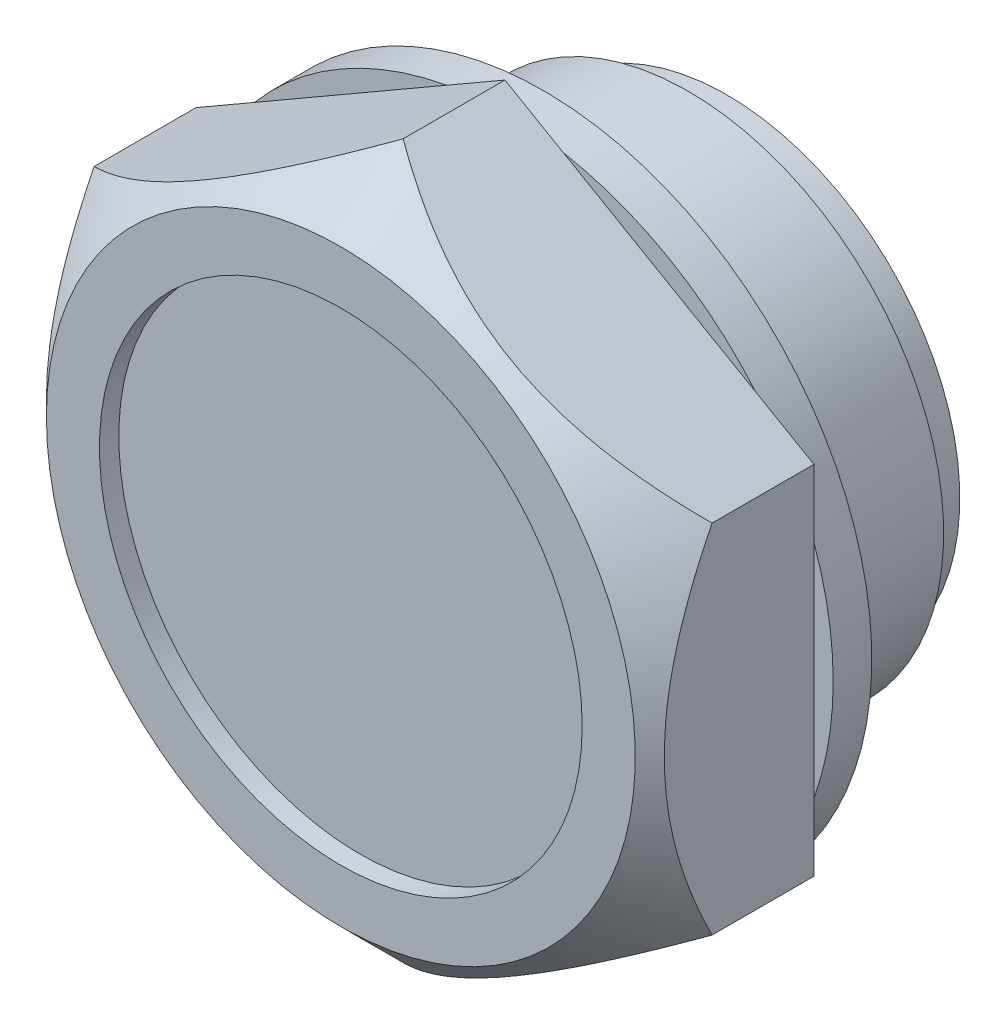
ISO-10303-21;
HEADER;
FILE_DESCRIPTION(('STEP AP214'),'2;1');
FILE_NAME('part.step','',(''),(''),'','','');
FILE_SCHEMA(('AUTOMOTIVE_DESIGN { 1 0 10303 214 1 1 1 1 }'));
ENDSEC;
DATA;
#1=APPLICATION_CONTEXT('core data for automotive mechanical design processes');
#2=APPLICATION_PROTOCOL_DEFINITION('international standard','automotive_design',2000,#1);
#3=PRODUCT_CONTEXT('',#1,'mechanical');
#4=PRODUCT('Part','Part','',(#3));
#5=PRODUCT_RELATED_PRODUCT_CATEGORY('part','',(#4));
#6=PRODUCT_DEFINITION_FORMATION('','',#4);
#7=PRODUCT_DEFINITION_CONTEXT('part definition',#1,'design');
#8=PRODUCT_DEFINITION('design','',#6,#7);
#9=PRODUCT_DEFINITION_SHAPE('','',#8);
#10=(LENGTH_UNIT() NAMED_UNIT(*) SI_UNIT(.MILLI.,.METRE.));
#11=(NAMED_UNIT(*) PLANE_ANGLE_UNIT() SI_UNIT($,.RADIAN.));
#12=(NAMED_UNIT(*) SI_UNIT($,.STERADIAN.) SOLID_ANGLE_UNIT());
#13=UNCERTAINTY_MEASURE_WITH_UNIT(LENGTH_MEASURE(1.E-05),#10,'distance_accuracy_value','');
#14=(GEOMETRIC_REPRESENTATION_CONTEXT(3) GLOBAL_UNCERTAINTY_ASSIGNED_CONTEXT((#13)) GLOBAL_UNIT_ASSIGNED_CONTEXT((#10,
#11,#12)) REPRESENTATION_CONTEXT('',''));
#15=CARTESIAN_POINT('',(0.,0.,0.));
#16=DIRECTION('',(0.,0.,1.));
#17=DIRECTION('',(1.,0.,0.));
#18=AXIS2_PLACEMENT_3D('',#15,#16,#17);
#19=CARTESIAN_POINT('',(0.,17.,2.));
#20=DIRECTION('',(0.,0.,-1.));
#21=DIRECTION('',(-1.,0.,0.));
#22=AXIS2_PLACEMENT_3D('',#19,#20,#21);
#23=PLANE('',#22);
#24=DIRECTION('',(0.866025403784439,0.5,0.));
#25=VECTOR('',#24,1.);
#26=CARTESIAN_POINT('',(-15.999999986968,9.23760429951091,2.));
#27=LINE('',#26,#25);
#28=CARTESIAN_POINT('',(-3.02506277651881,16.7286877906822,2.));
#29=VERTEX_POINT('',#28);
#30=CARTESIAN_POINT('',(4.09394740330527E-12,18.4752085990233,2.));
#31=VERTEX_POINT('',#30);
#32=EDGE_CURVE('E109',#29,#31,#27,.T.);
#33=ORIENTED_EDGE('',*,*,#32,.T.);
#34=DIRECTION('',(0.866025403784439,-0.5,0.));
#35=VECTOR('',#34,1.);
#36=CARTESIAN_POINT('',(4.09394740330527E-12,18.4752085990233,2.));
#37=LINE('',#36,#35);
#38=CARTESIAN_POINT('',(3.02506277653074,16.7286877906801,2.));
#39=VERTEX_POINT('',#38);
#40=EDGE_CURVE('E122',#31,#39,#37,.T.);
#41=ORIENTED_EDGE('',*,*,#40,.T.);
#42=CARTESIAN_POINT('',(0.,0.,2.));
#43=DIRECTION('',(0.,0.,-1.));
#44=DIRECTION('',(-1.,0.,0.));
#45=AXIS2_PLACEMENT_3D('',#42,#43,#44);
#46=CIRCLE('',#45,17.);
#47=EDGE_CURVE('E133',#29,#39,#46,.T.);
#48=ORIENTED_EDGE('',*,*,#47,.F.);
#49=EDGE_LOOP('',(#33,#41,#48));
#50=FACE_BOUND('',#49,.T.);
#51=ADVANCED_FACE('F15',(#50),#23,.T.);
#52=CARTESIAN_POINT('',(12.9749372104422,10.9841251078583,2.));
#53=VERTEX_POINT('',#52);
#54=CARTESIAN_POINT('',(16.0000000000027,9.2376042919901,2.));
#55=VERTEX_POINT('',#54);
#56=EDGE_CURVE('E132',#53,#55,#37,.T.);
#57=ORIENTED_EDGE('',*,*,#56,.T.);
#58=DIRECTION('',(-7.05455012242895E-10,-1.,0.));
#59=VECTOR('',#58,1.);
#60=CARTESIAN_POINT('',(16.0000000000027,9.2376042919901,2.));
#61=LINE('',#60,#59);
#62=CARTESIAN_POINT('',(15.9999999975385,5.744562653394,2.));
#63=VERTEX_POINT('',#62);
#64=EDGE_CURVE('E161',#55,#63,#61,.T.);
#65=ORIENTED_EDGE('',*,*,#64,.T.);
#66=EDGE_CURVE('E324',#53,#63,#46,.T.);
#67=ORIENTED_EDGE('',*,*,#66,.F.);
#68=EDGE_LOOP('',(#57,#65,#67));
#69=FACE_BOUND('',#68,.T.);
#70=ADVANCED_FACE('F294',(#69),#23,.T.);
#71=CARTESIAN_POINT('',(15.9999999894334,-5.7445626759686,2.));
#72=VERTEX_POINT('',#71);
#73=CARTESIAN_POINT('',(15.9999999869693,-9.23760429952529,2.));
#74=VERTEX_POINT('',#73);
#75=EDGE_CURVE('E130',#72,#74,#61,.T.);
#76=ORIENTED_EDGE('',*,*,#75,.T.);
#77=DIRECTION('',(-0.866025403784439,-0.5,0.));
#78=VECTOR('',#77,1.);
#79=CARTESIAN_POINT('',(15.9999999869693,-9.23760429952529,2.));
#80=LINE('',#79,#78);
#81=CARTESIAN_POINT('',(12.974937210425,-10.9841251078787,2.));
#82=VERTEX_POINT('',#81);
#83=EDGE_CURVE('E166',#74,#82,#80,.T.);
#84=ORIENTED_EDGE('',*,*,#83,.T.);
#85=EDGE_CURVE('E312',#72,#82,#46,.T.);
#86=ORIENTED_EDGE('',*,*,#85,.F.);
#87=EDGE_LOOP('',(#76,#84,#86));
#88=FACE_BOUND('',#87,.T.);
#89=ADVANCED_FACE('F298',(#88),#23,.T.);
#90=CARTESIAN_POINT('',(3.02506277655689,-16.7286877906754,2.));
#91=VERTEX_POINT('',#90);
#92=CARTESIAN_POINT('',(8.04217803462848E-12,-18.4752085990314,2.));
#93=VERTEX_POINT('',#92);
#94=EDGE_CURVE('E164',#91,#93,#80,.T.);
#95=ORIENTED_EDGE('',*,*,#94,.T.);
#96=DIRECTION('',(-0.866025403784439,0.5,0.));
#97=VECTOR('',#96,1.);
#98=CARTESIAN_POINT('',(8.04217803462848E-12,-18.4752085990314,2.));
#99=LINE('',#98,#97);
#100=CARTESIAN_POINT('',(-3.02506277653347,-16.7286877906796,2.));
#101=VERTEX_POINT('',#100);
#102=EDGE_CURVE('E172',#93,#101,#99,.T.);
#103=ORIENTED_EDGE('',*,*,#102,.T.);
#104=EDGE_CURVE('E380',#91,#101,#46,.T.);
#105=ORIENTED_EDGE('',*,*,#104,.F.);
#106=EDGE_LOOP('',(#95,#103,#105));
#107=FACE_BOUND('',#106,.T.);
#108=ADVANCED_FACE('F302',(#107),#23,.T.);
#109=CARTESIAN_POINT('',(-15.999999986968,9.23760429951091,2.));
#110=VERTEX_POINT('',#109);
#111=CARTESIAN_POINT('',(-12.97493721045,10.9841251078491,2.));
#112=VERTEX_POINT('',#111);
#113=EDGE_CURVE('E139',#110,#112,#27,.T.);
#114=ORIENTED_EDGE('',*,*,#113,.T.);
#115=CARTESIAN_POINT('',(-15.999999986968,5.74456268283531,2.));
#116=VERTEX_POINT('',#115);
#117=EDGE_CURVE('E24',#116,#112,#46,.T.);
#118=ORIENTED_EDGE('',*,*,#117,.F.);
#119=DIRECTION('',(0.,1.,0.));
#120=VECTOR('',#119,1.);
#121=CARTESIAN_POINT('',(-15.999999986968,-9.23760429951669,2.));
#122=LINE('',#121,#120);
#123=EDGE_CURVE('E176',#116,#110,#122,.T.);
#124=ORIENTED_EDGE('',*,*,#123,.T.);
#125=EDGE_LOOP('',(#114,#118,#124));
#126=FACE_BOUND('',#125,.T.);
#127=ADVANCED_FACE('F291',(#126),#23,.T.);
#128=CARTESIAN_POINT('',(0.,0.,-9.5));
#129=DIRECTION('',(0.,0.,-1.));
#130=DIRECTION('',(-1.,0.,0.));
#131=AXIS2_PLACEMENT_3D('',#128,#129,#130);
#132=PLANE('',#131);
#133=CARTESIAN_POINT('',(0.,0.,-9.5));
#134=DIRECTION('',(0.,0.,-1.));
#135=DIRECTION('',(-1.,0.,0.));
#136=AXIS2_PLACEMENT_3D('',#133,#134,#135);
#137=CIRCLE('',#136,12.0585);
#138=CARTESIAN_POINT('',(-12.0585,0.,-9.5));
#139=VERTEX_POINT('',#138);
#140=EDGE_CURVE('E349',#139,#139,#137,.T.);
#141=ORIENTED_EDGE('',*,*,#140,.T.);
#142=EDGE_LOOP('',(#141));
#143=FACE_BOUND('',#142,.T.);
#144=ADVANCED_FACE('F17',(#143),#132,.T.);
#145=CARTESIAN_POINT('',(-12.9749372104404,-10.9841251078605,2.));
#146=VERTEX_POINT('',#145);
#147=CARTESIAN_POINT('',(-15.999999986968,-9.23760429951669,2.));
#148=VERTEX_POINT('',#147);
#149=EDGE_CURVE('E170',#146,#148,#99,.T.);
#150=ORIENTED_EDGE('',*,*,#149,.T.);
#151=CARTESIAN_POINT('',(-15.999999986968,-5.7445626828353,2.));
#152=VERTEX_POINT('',#151);
#153=EDGE_CURVE('E178',#148,#152,#122,.T.);
#154=ORIENTED_EDGE('',*,*,#153,.T.);
#155=EDGE_CURVE('E391',#146,#152,#46,.T.);
#156=ORIENTED_EDGE('',*,*,#155,.F.);
#157=EDGE_LOOP('',(#150,#154,#156));
#158=FACE_BOUND('',#157,.T.);
#159=ADVANCED_FACE('F224',(#158),#23,.T.);
#160=CARTESIAN_POINT('',(0.,0.,-13.9684898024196));
#161=DIRECTION('',(0.,0.,-1.));
#162=DIRECTION('',(-1.,0.,0.));
#163=AXIS2_PLACEMENT_3D('',#160,#161,#162);
#164=CYLINDRICAL_SURFACE('',#163,17.);
#165=ORIENTED_EDGE('',*,*,#117,.T.);
#166=EDGE_CURVE('E332',#112,#29,#46,.T.);
#167=ORIENTED_EDGE('',*,*,#166,.T.);
#168=ORIENTED_EDGE('',*,*,#47,.T.);
#169=EDGE_CURVE('E326',#39,#53,#46,.T.);
#170=ORIENTED_EDGE('',*,*,#169,.T.);
#171=ORIENTED_EDGE('',*,*,#66,.T.);
#172=EDGE_CURVE('E321',#63,#72,#46,.T.);
#173=ORIENTED_EDGE('',*,*,#172,.T.);
#174=ORIENTED_EDGE('',*,*,#85,.T.);
#175=EDGE_CURVE('E384',#82,#91,#46,.T.);
#176=ORIENTED_EDGE('',*,*,#175,.T.);
#177=ORIENTED_EDGE('',*,*,#104,.T.);
#178=EDGE_CURVE('E388',#101,#146,#46,.T.);
#179=ORIENTED_EDGE('',*,*,#178,.T.);
#180=ORIENTED_EDGE('',*,*,#155,.T.);
#181=EDGE_CURVE('E333',#152,#116,#46,.T.);
#182=ORIENTED_EDGE('',*,*,#181,.T.);
#183=EDGE_LOOP('',(#165,#167,#168,#170,#171,#173,#174,#176,#177,#179,#180,#182));
#184=FACE_BOUND('',#183,.T.);
#185=CARTESIAN_POINT('',(0.,0.,0.));
#186=DIRECTION('',(0.,0.,-1.));
#187=DIRECTION('',(-1.,0.,0.));
#188=AXIS2_PLACEMENT_3D('',#185,#186,#187);
#189=CIRCLE('',#188,17.);
#190=CARTESIAN_POINT('',(-17.,0.,0.));
#191=VERTEX_POINT('',#190);
#192=EDGE_CURVE('E334',#191,#191,#189,.T.);
#193=ORIENTED_EDGE('',*,*,#192,.F.);
#194=EDGE_LOOP('',(#193));
#195=FACE_BOUND('',#194,.T.);
#196=ADVANCED_FACE('F282',(#184,#195),#164,.T.);
#197=CARTESIAN_POINT('',(0.,13.2205,0.));
#198=DIRECTION('',(0.,0.,-1.));
#199=DIRECTION('',(-1.,0.,0.));
#200=AXIS2_PLACEMENT_3D('',#197,#198,#199);
#201=PLANE('',#200);
#202=ORIENTED_EDGE('',*,*,#192,.T.);
#203=EDGE_LOOP('',(#202));
#204=FACE_BOUND('',#203,.T.);
#205=CARTESIAN_POINT('',(0.,0.,0.));
#206=DIRECTION('',(0.,0.,-1.));
#207=DIRECTION('',(-1.,0.,0.));
#208=AXIS2_PLACEMENT_3D('',#205,#206,#207);
#209=CIRCLE('',#208,13.2205);
#210=CARTESIAN_POINT('',(-13.2205,0.,0.));
#211=VERTEX_POINT('',#210);
#212=EDGE_CURVE('E338',#211,#211,#209,.T.);
#213=ORIENTED_EDGE('',*,*,#212,.F.);
#214=EDGE_LOOP('',(#213));
#215=FACE_BOUND('',#214,.T.);
#216=ADVANCED_FACE('F279',(#204,#215),#201,.T.);
#217=CARTESIAN_POINT('',(0.,0.,-13.9684898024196));
#218=DIRECTION('',(0.,0.,-1.));
#219=DIRECTION('',(-1.,0.,0.));
#220=AXIS2_PLACEMENT_3D('',#217,#218,#219);
#221=CYLINDRICAL_SURFACE('',#220,13.2205);
#222=CARTESIAN_POINT('',(0.,0.,-7.5));
#223=DIRECTION('',(0.,0.,-1.));
#224=DIRECTION('',(-1.,0.,0.));
#225=AXIS2_PLACEMENT_3D('',#222,#223,#224);
#226=CIRCLE('',#225,13.2205);
#227=CARTESIAN_POINT('',(-13.2205,0.,-7.5));
#228=VERTEX_POINT('',#227);
#229=EDGE_CURVE('E342',#228,#228,#226,.T.);
#230=ORIENTED_EDGE('',*,*,#229,.F.);
#231=EDGE_LOOP('',(#230));
#232=FACE_BOUND('',#231,.T.);
#233=ORIENTED_EDGE('',*,*,#212,.T.);
#234=EDGE_LOOP('',(#233));
#235=FACE_BOUND('',#234,.T.);
#236=ADVANCED_FACE('F275',(#232,#235),#221,.T.);
#237=CARTESIAN_POINT('',(0.,12.0585,-7.5));
#238=DIRECTION('',(0.,0.,-1.));
#239=DIRECTION('',(-1.,0.,0.));
#240=AXIS2_PLACEMENT_3D('',#237,#238,#239);
#241=PLANE('',#240);
#242=ORIENTED_EDGE('',*,*,#229,.T.);
#243=EDGE_LOOP('',(#242));
#244=FACE_BOUND('',#243,.T.);
#245=CARTESIAN_POINT('',(0.,0.,-7.5));
#246=DIRECTION('',(0.,0.,-1.));
#247=DIRECTION('',(-1.,0.,0.));
#248=AXIS2_PLACEMENT_3D('',#245,#246,#247);
#249=CIRCLE('',#248,12.0585);
#250=CARTESIAN_POINT('',(-12.0585,0.,-7.5));
#251=VERTEX_POINT('',#250);
#252=EDGE_CURVE('E346',#251,#251,#249,.T.);
#253=ORIENTED_EDGE('',*,*,#252,.F.);
#254=EDGE_LOOP('',(#253));
#255=FACE_BOUND('',#254,.T.);
#256=ADVANCED_FACE('F271',(#244,#255),#241,.T.);
#257=CARTESIAN_POINT('',(0.,0.,-13.9684898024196));
#258=DIRECTION('',(0.,0.,-1.));
#259=DIRECTION('',(-1.,0.,0.));
#260=AXIS2_PLACEMENT_3D('',#257,#258,#259);
#261=CYLINDRICAL_SURFACE('',#260,12.0585);
#262=ORIENTED_EDGE('',*,*,#140,.F.);
#263=EDGE_LOOP('',(#262));
#264=FACE_BOUND('',#263,.T.);
#265=ORIENTED_EDGE('',*,*,#252,.T.);
#266=EDGE_LOOP('',(#265));
#267=FACE_BOUND('',#266,.T.);
#268=ADVANCED_FACE('F268',(#264,#267),#261,.T.);
#269=CARTESIAN_POINT('',(-15.999999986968,9.23760429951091,2.));
#270=DIRECTION('',(0.5,-0.866025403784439,0.));
#271=DIRECTION('',(-0.866025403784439,-0.5,0.));
#272=AXIS2_PLACEMENT_3D('',#269,#270,#271);
#273=PLANE('',#272);
#274=DIRECTION('',(0.,0.,1.));
#275=VECTOR('',#274,1.);
#276=CARTESIAN_POINT('',(4.09394740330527E-12,18.4752085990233,2.));
#277=LINE('',#276,#275);
#278=CARTESIAN_POINT('',(4.09394740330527E-12,18.4752085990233,7.27479138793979));
#279=VERTEX_POINT('',#278);
#280=EDGE_CURVE('E104',#31,#279,#277,.T.);
#281=ORIENTED_EDGE('',*,*,#280,.F.);
#282=ORIENTED_EDGE('',*,*,#32,.F.);
#283=EDGE_CURVE('E136',#112,#29,#27,.T.);
#284=ORIENTED_EDGE('',*,*,#283,.F.);
#285=ORIENTED_EDGE('',*,*,#113,.F.);
#286=DIRECTION('',(0.,0.,1.));
#287=VECTOR('',#286,1.);
#288=CARTESIAN_POINT('',(-15.999999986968,9.23760429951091,2.));
#289=LINE('',#288,#287);
#290=CARTESIAN_POINT('',(-15.999999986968,9.23760429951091,7.27479138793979));
#291=VERTEX_POINT('',#290);
#292=EDGE_CURVE('E182',#110,#291,#289,.T.);
#293=ORIENTED_EDGE('',*,*,#292,.T.);
#294=CARTESIAN_POINT('',(0.000200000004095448,18.4753240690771,7.27467591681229));
#295=CARTESIAN_POINT('',(-0.274873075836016,18.316510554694,7.43346500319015));
#296=CARTESIAN_POINT('',(-0.552100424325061,18.1564532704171,7.58740864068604));
#297=CARTESIAN_POINT('',(-1.11119892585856,17.8336576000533,7.88406590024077));
#298=CARTESIAN_POINT('',(-1.39307251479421,17.6709178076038,8.02677338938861));
#299=CARTESIAN_POINT('',(-1.96312819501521,17.3417960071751,8.30002357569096));
#300=CARTESIAN_POINT('',(-2.2513371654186,17.1753984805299,8.43049194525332));
#301=CARTESIAN_POINT('',(-2.83248894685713,16.8398703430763,8.67643022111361));
#302=CARTESIAN_POINT('',(-3.12543102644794,16.6707401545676,8.79190242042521));
#303=CARTESIAN_POINT('',(-3.71133791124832,16.332466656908,9.00419506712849));
#304=CARTESIAN_POINT('',(-4.00423072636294,16.1633649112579,9.10127894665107));
#305=CARTESIAN_POINT('',(-4.59412538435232,15.8227890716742,9.27703969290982));
#306=CARTESIAN_POINT('',(-4.89112678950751,15.6513152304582,9.35571850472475));
#307=CARTESIAN_POINT('',(-5.48795464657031,15.3067365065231,9.49269195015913));
#308=CARTESIAN_POINT('',(-5.78777314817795,15.1336362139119,9.55103248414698));
#309=CARTESIAN_POINT('',(-6.38996474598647,14.7859607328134,9.64603292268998));
#310=CARTESIAN_POINT('',(-6.69233745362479,14.6113857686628,9.68269606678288));
#311=CARTESIAN_POINT('',(-7.21228046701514,14.3111965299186,9.72611550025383));
#312=CARTESIAN_POINT('',(-7.42951394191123,14.1857767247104,9.7384116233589));
#313=CARTESIAN_POINT('',(-7.86423666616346,13.9347894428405,9.75119864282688));
#314=CARTESIAN_POINT('',(-8.08172590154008,13.80922197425,9.75169015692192));
#315=CARTESIAN_POINT('',(-8.51656301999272,13.5581686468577,9.74085342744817));
#316=CARTESIAN_POINT('',(-8.73391082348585,13.4326828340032,9.72952090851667));
#317=CARTESIAN_POINT('',(-9.16790378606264,13.1821168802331,9.69521554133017));
#318=CARTESIAN_POINT('',(-9.38454893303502,13.0570367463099,9.6722424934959));
#319=CARTESIAN_POINT('',(-10.0332285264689,12.6825214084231,9.58626640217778));
#320=CARTESIAN_POINT('',(-10.4636398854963,12.4340232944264,9.5062164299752));
#321=CARTESIAN_POINT('',(-11.3169944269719,11.9413388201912,9.30503457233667));
#322=CARTESIAN_POINT('',(-11.7399381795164,11.6971521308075,9.18390583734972));
#323=CARTESIAN_POINT('',(-12.4907260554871,11.2636845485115,8.93472063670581));
#324=CARTESIAN_POINT('',(-12.8202293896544,11.0734457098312,8.81321948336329));
#325=CARTESIAN_POINT('',(-13.4733181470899,10.6963847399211,8.55063894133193));
#326=CARTESIAN_POINT('',(-13.7969033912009,10.5095627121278,8.40955896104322));
#327=CARTESIAN_POINT('',(-14.4371411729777,10.1399212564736,8.11098332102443));
#328=CARTESIAN_POINT('',(-14.7538119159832,9.95709131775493,7.95353928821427));
#329=CARTESIAN_POINT('',(-15.3812901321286,9.59481660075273,7.62430209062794));
#330=CARTESIAN_POINT('',(-15.6921010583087,9.41536982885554,7.45251772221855));
#331=CARTESIAN_POINT('',(-16.0001999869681,9.23748882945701,7.27467591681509));
#332=B_SPLINE_CURVE_WITH_KNOTS('',3,(#294,#295,#296,#297,#298,#299,#300,#301,#302,#303,#304,
#305,#306,#307,#308,#309,#310,#311,#312,#313,#314,#315,#316,#317,#318,#319,#320,#321,#322,#323,
#324,#325,#326,#327,#328,#329,#330,#331),.UNSPECIFIED.,.F.,.F.,(4,2,2,2,2,2,2,2,2,2,2,2,2,2,2,2,
2,2,4),(0.,1.06536581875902,2.13130916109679,3.20335555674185,4.27523783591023,5.33035841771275,
6.38536744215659,7.43797982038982,8.49043485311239,9.24359927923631,9.99672429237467,
10.7501217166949,11.5035320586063,13.0116203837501,14.5195930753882,15.7172424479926,
16.9149280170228,18.1089435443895,19.3022319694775),.UNSPECIFIED.);
#333=EDGE_CURVE('E113',#279,#291,#332,.T.);
#334=ORIENTED_EDGE('',*,*,#333,.F.);
#335=EDGE_LOOP('',(#281,#282,#284,#285,#293,#334));
#336=FACE_BOUND('',#335,.T.);
#337=ADVANCED_FACE('F106',(#336),#273,.F.);
#338=CARTESIAN_POINT('',(4.09394740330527E-12,18.4752085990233,2.));
#339=DIRECTION('',(-0.5,-0.866025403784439,0.));
#340=DIRECTION('',(-0.866025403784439,0.5,0.));
#341=AXIS2_PLACEMENT_3D('',#338,#339,#340);
#342=PLANE('',#341);
#343=DIRECTION('',(0.,0.,1.));
#344=VECTOR('',#343,1.);
#345=CARTESIAN_POINT('',(16.0000000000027,9.2376042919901,2.));
#346=LINE('',#345,#344);
#347=CARTESIAN_POINT('',(16.0000000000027,9.2376042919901,7.27479138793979));
#348=VERTEX_POINT('',#347);
#349=EDGE_CURVE('E118',#55,#348,#346,.T.);
#350=ORIENTED_EDGE('',*,*,#349,.F.);
#351=ORIENTED_EDGE('',*,*,#56,.F.);
#352=EDGE_CURVE('E125',#39,#53,#37,.T.);
#353=ORIENTED_EDGE('',*,*,#352,.F.);
#354=ORIENTED_EDGE('',*,*,#40,.F.);
#355=ORIENTED_EDGE('',*,*,#280,.T.);
#356=CARTESIAN_POINT('',(16.0002000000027,9.2374888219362,7.2746759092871));
#357=CARTESIAN_POINT('',(15.7251269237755,9.39630233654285,7.43346499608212));
#358=CARTESIAN_POINT('',(15.4478995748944,9.55635962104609,7.58740863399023));
#359=CARTESIAN_POINT('',(14.8888010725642,9.87915529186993,7.88406589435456));
#360=CARTESIAN_POINT('',(14.606927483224,10.041895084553,8.02677338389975));
#361=CARTESIAN_POINT('',(14.0368718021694,10.3710168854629,8.30002357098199));
#362=CARTESIAN_POINT('',(13.7486628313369,10.5374144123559,8.43049194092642));
#363=CARTESIAN_POINT('',(13.1675110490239,10.8729425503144,8.67643021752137));
#364=CARTESIAN_POINT('',(12.8745689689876,11.0420727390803,8.79190241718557));
#365=CARTESIAN_POINT('',(12.2886620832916,11.3803462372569,9.0041950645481));
#366=CARTESIAN_POINT('',(11.9957692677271,11.5494479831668,9.10127894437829));
#367=CARTESIAN_POINT('',(11.4058746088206,11.8900238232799,9.2770396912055));
#368=CARTESIAN_POINT('',(11.1088732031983,12.0614976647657,9.3557185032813));
#369=CARTESIAN_POINT('',(10.5120453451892,12.4060763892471,9.49269194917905));
#370=CARTESIAN_POINT('',(10.2122268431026,12.5791766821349,9.55103248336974));
#371=CARTESIAN_POINT('',(9.61003524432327,12.9268521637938,9.64603292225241));
#372=CARTESIAN_POINT('',(9.30766253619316,13.1014271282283,9.68269606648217));
#373=CARTESIAN_POINT('',(8.78771952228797,13.4016163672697,9.72611550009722));
#374=CARTESIAN_POINT('',(8.57048604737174,13.5270361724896,9.73841162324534));
#375=CARTESIAN_POINT('',(8.13576332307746,13.7780234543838,9.75119864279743));
#376=CARTESIAN_POINT('',(7.91827408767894,13.903590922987,9.75169015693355));
#377=CARTESIAN_POINT('',(7.48343696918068,14.1546442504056,9.74085342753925));
#378=CARTESIAN_POINT('',(7.26608916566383,14.2801300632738,9.72952090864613));
#379=CARTESIAN_POINT('',(6.83209620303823,14.5306960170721,9.69521554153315));
#380=CARTESIAN_POINT('',(6.61545105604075,14.6557761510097,9.67224249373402));
#381=CARTESIAN_POINT('',(5.96677146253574,15.0302914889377,9.58626640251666));
#382=CARTESIAN_POINT('',(5.53636010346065,15.278789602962,9.5062164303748));
#383=CARTESIAN_POINT('',(4.68300556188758,15.7714740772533,9.30503457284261));
#384=CARTESIAN_POINT('',(4.26006180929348,16.0156607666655,9.1839058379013));
#385=CARTESIAN_POINT('',(3.50927393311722,16.4491283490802,8.93472063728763));
#386=CARTESIAN_POINT('',(3.17977059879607,16.6393671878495,8.81321948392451));
#387=CARTESIAN_POINT('',(2.52668184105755,17.0164281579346,8.55063894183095));
#388=CARTESIAN_POINT('',(2.20309659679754,17.2032501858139,8.40955896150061));
#389=CARTESIAN_POINT('',(1.5628588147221,17.5728916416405,8.1109833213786));
#390=CARTESIAN_POINT('',(1.24618807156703,17.7557215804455,7.95353928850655));
#391=CARTESIAN_POINT('',(0.618709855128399,18.117996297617,7.62430209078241));
#392=CARTESIAN_POINT('',(0.307898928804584,18.2974430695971,7.4525177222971));
#393=CARTESIAN_POINT('',(-0.000199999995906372,18.4753240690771,7.27467591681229));
#394=B_SPLINE_CURVE_WITH_KNOTS('',3,(#356,#357,#358,#359,#360,#361,#362,#363,#364,#365,#366,
#367,#368,#369,#370,#371,#372,#373,#374,#375,#376,#377,#378,#379,#380,#381,#382,#383,#384,#385,
#386,#387,#388,#389,#390,#391,#392,#393),.UNSPECIFIED.,.F.,.F.,(4,2,2,2,2,2,2,2,2,2,2,2,2,2,2,2,
2,2,4),(0.,1.06536582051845,2.13130916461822,3.20335556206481,4.27523784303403,5.33035842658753,
6.38536745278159,7.4379798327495,8.49043486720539,9.24359929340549,9.99672430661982,
10.7501217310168,11.5035320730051,13.0116203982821,14.5195930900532,15.7172424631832,
16.9149280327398,18.1089435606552,19.3022319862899),.UNSPECIFIED.);
#395=EDGE_CURVE('E246',#348,#279,#394,.T.);
#396=ORIENTED_EDGE('',*,*,#395,.F.);
#397=EDGE_LOOP('',(#350,#351,#353,#354,#355,#396));
#398=FACE_BOUND('',#397,.T.);
#399=ADVANCED_FACE('F123',(#398),#342,.F.);
#400=CARTESIAN_POINT('',(16.0000000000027,9.2376042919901,2.));
#401=DIRECTION('',(-1.,7.05455012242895E-10,0.));
#402=DIRECTION('',(7.05455012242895E-10,1.,0.));
#403=AXIS2_PLACEMENT_3D('',#400,#401,#402);
#404=PLANE('',#403);
#405=DIRECTION('',(0.,0.,1.));
#406=VECTOR('',#405,1.);
#407=CARTESIAN_POINT('',(15.9999999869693,-9.23760429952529,2.));
#408=LINE('',#407,#406);
#409=CARTESIAN_POINT('',(15.9999999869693,-9.23760429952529,7.27479138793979));
#410=VERTEX_POINT('',#409);
#411=EDGE_CURVE('E191',#74,#410,#408,.T.);
#412=ORIENTED_EDGE('',*,*,#411,.F.);
#413=ORIENTED_EDGE('',*,*,#75,.F.);
#414=EDGE_CURVE('E165',#63,#72,#61,.T.);
#415=ORIENTED_EDGE('',*,*,#414,.F.);
#416=ORIENTED_EDGE('',*,*,#64,.F.);
#417=ORIENTED_EDGE('',*,*,#349,.T.);
#418=CARTESIAN_POINT('',(15.9999999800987,-18.9766913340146,0.928339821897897));
#419=CARTESIAN_POINT('',(15.9999999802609,-18.746877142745,1.1040346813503));
#420=CARTESIAN_POINT('',(15.9999999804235,-18.5164265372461,1.2788964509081));
#421=CARTESIAN_POINT('',(15.9999999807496,-18.054146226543,1.62679531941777));
#422=CARTESIAN_POINT('',(15.9999999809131,-17.8223164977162,1.79983238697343));
#423=CARTESIAN_POINT('',(15.9999999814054,-17.1245063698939,2.31603724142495));
#424=CARTESIAN_POINT('',(15.9999999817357,-16.6563084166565,2.65621942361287));
#425=CARTESIAN_POINT('',(15.9999999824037,-15.7094360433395,3.32959149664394));
#426=CARTESIAN_POINT('',(15.9999999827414,-15.2307086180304,3.66270701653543));
#427=CARTESIAN_POINT('',(15.9999999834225,-14.2652298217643,4.31706338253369));
#428=CARTESIAN_POINT('',(15.9999999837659,-13.7784790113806,4.63830505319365));
#429=CARTESIAN_POINT('',(15.9999999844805,-12.7655565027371,5.28543641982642));
#430=CARTESIAN_POINT('',(15.9999999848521,-12.2387951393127,5.61040773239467));
#431=CARTESIAN_POINT('',(15.999999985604,-11.1729235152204,6.23976792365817));
#432=CARTESIAN_POINT('',(15.9999999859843,-10.6338112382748,6.54415340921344));
#433=CARTESIAN_POINT('',(15.9999999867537,-9.54316200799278,7.12582877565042));
#434=CARTESIAN_POINT('',(15.9999999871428,-8.99166784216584,7.40319826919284));
#435=CARTESIAN_POINT('',(15.9999999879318,-7.87326854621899,7.92462900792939));
#436=CARTESIAN_POINT('',(15.9999999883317,-7.30637073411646,8.16870574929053));
#437=CARTESIAN_POINT('',(15.9999999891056,-6.20930944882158,8.59412127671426));
#438=CARTESIAN_POINT('',(15.9999999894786,-5.68059858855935,8.77917494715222));
#439=CARTESIAN_POINT('',(15.9999999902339,-4.60986280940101,9.10693512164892));
#440=CARTESIAN_POINT('',(15.9999999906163,-4.06783702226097,9.24963885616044));
#441=CARTESIAN_POINT('',(15.9999999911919,-3.25190269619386,9.42499213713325));
#442=CARTESIAN_POINT('',(15.9999999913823,-2.98200989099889,9.4766801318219));
#443=CARTESIAN_POINT('',(15.9999999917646,-2.44009014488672,9.56720843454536));
#444=CARTESIAN_POINT('',(15.9999999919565,-2.16806350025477,9.60605049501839));
#445=CARTESIAN_POINT('',(15.9999999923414,-1.6224399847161,9.67023281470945));
#446=CARTESIAN_POINT('',(15.9999999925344,-1.34884323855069,9.69557413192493));
#447=CARTESIAN_POINT('',(15.9999999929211,-0.800711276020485,9.73231048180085));
#448=CARTESIAN_POINT('',(15.9999999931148,-0.526176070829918,9.74370567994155));
#449=CARTESIAN_POINT('',(15.9999999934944,0.011849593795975,9.75216323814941));
#450=CARTESIAN_POINT('',(15.9999999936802,0.275331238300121,9.74979427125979));
#451=CARTESIAN_POINT('',(15.9999999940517,0.801885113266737,9.73207967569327));
#452=CARTESIAN_POINT('',(15.9999999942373,1.06495729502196,9.71673260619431));
#453=CARTESIAN_POINT('',(15.9999999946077,1.59003377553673,9.67331599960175));
#454=CARTESIAN_POINT('',(15.9999999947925,1.8520381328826,9.64524717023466));
#455=CARTESIAN_POINT('',(15.9999999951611,2.37445310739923,9.57684662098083));
#456=CARTESIAN_POINT('',(15.9999999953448,2.63486351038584,9.53651328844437));
#457=CARTESIAN_POINT('',(15.9999999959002,3.42214842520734,9.39635593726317));
#458=CARTESIAN_POINT('',(15.9999999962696,3.94583431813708,9.27816696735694));
#459=CARTESIAN_POINT('',(15.9999999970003,4.98162600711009,8.99985914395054));
#460=CARTESIAN_POINT('',(15.9999999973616,5.49373257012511,8.83974307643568));
#461=CARTESIAN_POINT('',(15.9999999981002,6.54074357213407,8.47213735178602));
#462=CARTESIAN_POINT('',(15.9999999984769,7.0747548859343,8.26212657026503));
#463=CARTESIAN_POINT('',(15.9999999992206,8.12899321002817,7.80972137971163));
#464=CARTESIAN_POINT('',(15.9999999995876,8.64921380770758,7.56731221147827));
#465=CARTESIAN_POINT('',(16.0000000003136,9.67836399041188,7.05586433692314));
#466=CARTESIAN_POINT('',(16.0000000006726,10.1872522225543,6.78674307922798));
#467=CARTESIAN_POINT('',(16.0000000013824,11.1933518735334,6.22780208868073));
#468=CARTESIAN_POINT('',(16.0000000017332,11.6905650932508,5.9379855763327));
#469=CARTESIAN_POINT('',(16.0000000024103,12.6504962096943,5.35645654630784));
#470=CARTESIAN_POINT('',(16.0000000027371,13.1137034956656,5.06554765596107));
#471=CARTESIAN_POINT('',(16.000000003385,14.0321620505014,4.47139694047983));
#472=CARTESIAN_POINT('',(16.0000000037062,14.4874127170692,4.16815418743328));
#473=CARTESIAN_POINT('',(16.0000000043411,15.387325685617,3.55399764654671));
#474=CARTESIAN_POINT('',(16.0000000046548,15.8320437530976,3.24316537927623));
#475=CARTESIAN_POINT('',(16.0000000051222,16.4945916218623,2.77071287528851));
#476=CARTESIAN_POINT('',(16.0000000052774,16.7146581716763,2.61221536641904));
#477=CARTESIAN_POINT('',(16.0000000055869,17.1533959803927,2.29330969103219));
#478=CARTESIAN_POINT('',(16.0000000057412,17.3720672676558,2.13290156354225));
#479=CARTESIAN_POINT('',(16.000000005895,17.5900928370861,1.97161976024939));
#480=B_SPLINE_CURVE_WITH_KNOTS('',3,(#418,#419,#420,#421,#422,#423,#424,#425,#426,#427,#428,
#429,#430,#431,#432,#433,#434,#435,#436,#437,#438,#439,#440,#441,#442,#443,#444,#445,#446,#447,
#448,#449,#450,#451,#452,#453,#454,#455,#456,#457,#458,#459,#460,#461,#462,#463,#464,#465,#466,
#467,#468,#469,#470,#471,#472,#473,#474,#475,#476,#477,#478,#479),.UNSPECIFIED.,.F.,.F.,(4,2,2,
2,2,2,2,2,2,2,2,2,2,2,2,2,2,2,2,2,2,2,2,2,2,2,2,2,2,2,4),(0.,0.867838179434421,1.73569126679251,
3.47178820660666,5.22130427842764,6.97069862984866,8.8271383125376,10.6838832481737,
12.5349796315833,14.3852114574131,16.0642962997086,17.7434909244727,18.5676273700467,
19.3916513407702,20.2156107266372,21.0395603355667,21.8297168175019,22.6199610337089,
23.4101612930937,24.2004655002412,25.8087949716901,27.4170175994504,29.1371437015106,
30.8580561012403,32.5844630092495,34.3106018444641,35.9513164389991,37.5921546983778,
39.2197688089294,40.0333676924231,40.8469499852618),.UNSPECIFIED.);
#481=EDGE_CURVE('E239',#410,#348,#480,.T.);
#482=ORIENTED_EDGE('',*,*,#481,.F.);
#483=EDGE_LOOP('',(#412,#413,#415,#416,#417,#482));
#484=FACE_BOUND('',#483,.T.);
#485=ADVANCED_FACE('F261',(#484),#404,.F.);
#486=CARTESIAN_POINT('',(15.9999999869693,-9.23760429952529,2.));
#487=DIRECTION('',(-0.5,0.866025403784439,0.));
#488=DIRECTION('',(0.866025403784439,0.5,0.));
#489=AXIS2_PLACEMENT_3D('',#486,#487,#488);
#490=PLANE('',#489);
#491=DIRECTION('',(0.,0.,1.));
#492=VECTOR('',#491,1.);
#493=CARTESIAN_POINT('',(8.04217803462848E-12,-18.4752085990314,2.));
#494=LINE('',#493,#492);
#495=CARTESIAN_POINT('',(8.04217803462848E-12,-18.4752085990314,7.27479138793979));
#496=VERTEX_POINT('',#495);
#497=EDGE_CURVE('E187',#93,#496,#494,.T.);
#498=ORIENTED_EDGE('',*,*,#497,.F.);
#499=ORIENTED_EDGE('',*,*,#94,.F.);
#500=EDGE_CURVE('E171',#82,#91,#80,.T.);
#501=ORIENTED_EDGE('',*,*,#500,.F.);
#502=ORIENTED_EDGE('',*,*,#83,.F.);
#503=ORIENTED_EDGE('',*,*,#411,.T.);
#504=CARTESIAN_POINT('',(-0.000199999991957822,-18.4753240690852,7.2746759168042));
#505=CARTESIAN_POINT('',(0.274873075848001,-18.3165105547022,7.43346500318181));
#506=CARTESIAN_POINT('',(0.552100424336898,-18.1564532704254,7.58740864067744));
#507=CARTESIAN_POINT('',(1.1111989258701,-17.8336576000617,7.88406590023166));
#508=CARTESIAN_POINT('',(1.3930725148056,-17.6709178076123,8.02677338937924));
#509=CARTESIAN_POINT('',(1.96312819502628,-17.3417960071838,8.30002357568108));
#510=CARTESIAN_POINT('',(2.25133716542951,-17.1753984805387,8.4304919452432));
#511=CARTESIAN_POINT('',(2.83248894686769,-16.8398703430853,8.67643022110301));
#512=CARTESIAN_POINT('',(3.12543102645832,-16.6707401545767,8.79190242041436));
#513=CARTESIAN_POINT('',(3.71133791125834,-16.3324666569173,9.0041950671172));
#514=CARTESIAN_POINT('',(4.00423072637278,-16.1633649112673,9.10127894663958));
#515=CARTESIAN_POINT('',(4.5941253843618,-15.8227890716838,9.27703969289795));
#516=CARTESIAN_POINT('',(4.89112678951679,-15.6513152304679,9.3557185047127));
#517=CARTESIAN_POINT('',(5.4879546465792,-15.306736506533,9.49269195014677));
#518=CARTESIAN_POINT('',(5.78777314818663,-15.1336362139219,9.55103248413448));
#519=CARTESIAN_POINT('',(6.38996474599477,-14.7859607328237,9.64603292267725));
#520=CARTESIAN_POINT('',(6.6923374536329,-14.6113857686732,9.68269606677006));
#521=CARTESIAN_POINT('',(7.2122804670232,-14.3111965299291,9.7261155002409));
#522=CARTESIAN_POINT('',(7.42951394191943,-14.1857767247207,9.73841162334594));
#523=CARTESIAN_POINT('',(7.86423666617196,-13.9347894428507,9.75119864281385));
#524=CARTESIAN_POINT('',(8.08172590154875,-13.80922197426,9.75169015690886));
#525=CARTESIAN_POINT('',(8.51656302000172,-13.5581686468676,9.74085342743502));
#526=CARTESIAN_POINT('',(8.733910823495,-13.432682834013,9.72952090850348));
#527=CARTESIAN_POINT('',(9.1679037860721,-13.1821168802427,9.69521554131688));
#528=CARTESIAN_POINT('',(9.38454893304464,-13.0570367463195,9.67224249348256));
#529=CARTESIAN_POINT('',(10.033228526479,-12.6825214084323,9.58626640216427));
#530=CARTESIAN_POINT('',(10.4636398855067,-12.4340232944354,9.5062164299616));
#531=CARTESIAN_POINT('',(11.3169944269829,-11.9413388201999,9.30503457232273));
#532=CARTESIAN_POINT('',(11.7399381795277,-11.6971521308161,9.18390583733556));
#533=CARTESIAN_POINT('',(12.4907260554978,-11.2636845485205,8.93472063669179));
#534=CARTESIAN_POINT('',(12.8202293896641,-11.0734457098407,8.81321948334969));
#535=CARTESIAN_POINT('',(13.4733181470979,-10.6963847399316,8.5506389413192));
#536=CARTESIAN_POINT('',(13.7969033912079,-10.5095627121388,8.40955896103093));
#537=CARTESIAN_POINT('',(14.4371411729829,-10.1399212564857,8.11098332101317));
#538=CARTESIAN_POINT('',(14.7538119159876,-9.95709131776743,7.95353928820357));
#539=CARTESIAN_POINT('',(15.3812901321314,-9.59481660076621,7.62430209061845));
#540=CARTESIAN_POINT('',(15.6921010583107,-9.41536982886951,7.45251772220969));
#541=CARTESIAN_POINT('',(16.0001999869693,-9.23748882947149,7.27467591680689));
#542=B_SPLINE_CURVE_WITH_KNOTS('',3,(#504,#505,#506,#507,#508,#509,#510,#511,#512,#513,#514,
#515,#516,#517,#518,#519,#520,#521,#522,#523,#524,#525,#526,#527,#528,#529,#530,#531,#532,#533,
#534,#535,#536,#537,#538,#539,#540,#541),.UNSPECIFIED.,.F.,.F.,(4,2,2,2,2,2,2,2,2,2,2,2,2,2,2,2,
2,2,4),(0.,1.06536581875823,2.13130916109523,3.20335555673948,4.27523783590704,5.33035841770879,
6.38536744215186,7.43797982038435,8.49043485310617,9.24359927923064,9.99672429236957,
10.7501217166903,11.5035320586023,13.0116203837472,14.5195930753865,15.7172424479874,
16.9149280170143,18.1089435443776,19.3022319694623),.UNSPECIFIED.);
#543=EDGE_CURVE('E232',#496,#410,#542,.T.);
#544=ORIENTED_EDGE('',*,*,#543,.F.);
#545=EDGE_LOOP('',(#498,#499,#501,#502,#503,#544));
#546=FACE_BOUND('',#545,.T.);
#547=ADVANCED_FACE('F361',(#546),#490,.F.);
#548=CARTESIAN_POINT('',(8.04217803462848E-12,-18.4752085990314,2.));
#549=DIRECTION('',(0.5,0.866025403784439,0.));
#550=DIRECTION('',(0.866025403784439,-0.5,0.));
#551=AXIS2_PLACEMENT_3D('',#548,#549,#550);
#552=PLANE('',#551);
#553=DIRECTION('',(0.,0.,1.));
#554=VECTOR('',#553,1.);
#555=CARTESIAN_POINT('',(-15.999999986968,-9.23760429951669,2.));
#556=LINE('',#555,#554);
#557=CARTESIAN_POINT('',(-15.999999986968,-9.23760429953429,7.27479138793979));
#558=VERTEX_POINT('',#557);
#559=EDGE_CURVE('E31',#148,#558,#556,.T.);
#560=ORIENTED_EDGE('',*,*,#559,.F.);
#561=ORIENTED_EDGE('',*,*,#149,.F.);
#562=EDGE_CURVE('E177',#101,#146,#99,.T.);
#563=ORIENTED_EDGE('',*,*,#562,.F.);
#564=ORIENTED_EDGE('',*,*,#102,.F.);
#565=ORIENTED_EDGE('',*,*,#497,.T.);
#566=CARTESIAN_POINT('',(-16.0001999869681,-9.23748882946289,7.27467591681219));
#567=CARTESIAN_POINT('',(-15.7251269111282,-9.39630234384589,7.43346500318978));
#568=CARTESIAN_POINT('',(-15.4478995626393,-9.55635962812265,7.58740864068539));
#569=CARTESIAN_POINT('',(-14.8888010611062,-9.87915529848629,7.8840659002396));
#570=CARTESIAN_POINT('',(-14.6069274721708,-10.0418950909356,8.02677338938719));
#571=CARTESIAN_POINT('',(-14.0368717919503,-10.371016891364,8.30002357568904));
#572=CARTESIAN_POINT('',(-13.7486628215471,-10.5374144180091,8.43049194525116));
#573=CARTESIAN_POINT('',(-13.167511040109,-10.8729425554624,8.67643022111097));
#574=CARTESIAN_POINT('',(-12.8745689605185,-11.042072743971,8.79190242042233));
#575=CARTESIAN_POINT('',(-12.2886620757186,-11.3803462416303,9.00419506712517));
#576=CARTESIAN_POINT('',(-11.9957692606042,-11.5494479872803,9.10127894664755));
#577=CARTESIAN_POINT('',(-11.4058746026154,-11.8900238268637,9.27703969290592));
#578=CARTESIAN_POINT('',(-11.1088731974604,-12.0614976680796,9.35571850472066));
#579=CARTESIAN_POINT('',(-10.5120453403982,-12.4060763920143,9.49269195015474));
#580=CARTESIAN_POINT('',(-10.2122268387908,-12.5791766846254,9.55103248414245));
#581=CARTESIAN_POINT('',(-9.61003524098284,-12.9268521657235,9.64603292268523));
#582=CARTESIAN_POINT('',(-9.30766253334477,-13.1014271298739,9.68269606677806));
#583=CARTESIAN_POINT('',(-8.78771951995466,-13.4016163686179,9.7261155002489));
#584=CARTESIAN_POINT('',(-8.57048604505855,-13.5270361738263,9.73841162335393));
#585=CARTESIAN_POINT('',(-8.13576332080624,-13.7780234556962,9.75119864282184));
#586=CARTESIAN_POINT('',(-7.91827408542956,-13.9035909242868,9.75169015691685));
#587=CARTESIAN_POINT('',(-7.48343696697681,-14.1546442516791,9.74085342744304));
#588=CARTESIAN_POINT('',(-7.26608916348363,-14.2801300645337,9.72952090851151));
#589=CARTESIAN_POINT('',(-6.83209620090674,-14.5306960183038,9.69521554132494));
#590=CARTESIAN_POINT('',(-6.61545105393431,-14.655776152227,9.67224249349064));
#591=CARTESIAN_POINT('',(-5.96677146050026,-15.030291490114,9.58626640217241));
#592=CARTESIAN_POINT('',(-5.53636010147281,-15.2787896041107,9.50621642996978));
#593=CARTESIAN_POINT('',(-4.68300555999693,-15.771474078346,9.30503457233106));
#594=CARTESIAN_POINT('',(-4.26006180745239,-16.0156607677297,9.18390583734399));
#595=CARTESIAN_POINT('',(-3.50927393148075,-16.4491283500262,8.93472063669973));
#596=CARTESIAN_POINT('',(-3.17977059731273,-16.639367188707,8.8132194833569));
#597=CARTESIAN_POINT('',(-2.52668183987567,-17.016428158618,8.55063894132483));
#598=CARTESIAN_POINT('',(-2.20309659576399,-17.2032501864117,8.40955896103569));
#599=CARTESIAN_POINT('',(-1.56285881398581,-17.5728916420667,8.11098332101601));
#600=CARTESIAN_POINT('',(-1.24618807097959,-17.7557215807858,7.95353928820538));
#601=CARTESIAN_POINT('',(-0.61870985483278,-18.1179962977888,7.62430209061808));
#602=CARTESIAN_POINT('',(-0.307898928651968,-18.2974430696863,7.45251772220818));
#603=CARTESIAN_POINT('',(0.000200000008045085,-18.4753240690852,7.2746759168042));
#604=B_SPLINE_CURVE_WITH_KNOTS('',3,(#566,#567,#568,#569,#570,#571,#572,#573,#574,#575,#576,
#577,#578,#579,#580,#581,#582,#583,#584,#585,#586,#587,#588,#589,#590,#591,#592,#593,#594,#595,
#596,#597,#598,#599,#600,#601,#602,#603),.UNSPECIFIED.,.F.,.F.,(4,2,2,2,2,2,2,2,2,2,2,2,2,2,2,2,
2,2,4),(0.,1.06536581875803,2.13130916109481,3.20335555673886,4.27523783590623,5.33035841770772,
6.38536744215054,7.43797982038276,8.49043485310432,9.24359927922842,9.99672429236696,
10.7501217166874,11.503532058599,13.0116203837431,14.5195930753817,15.7172424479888,
16.9149280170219,18.1089435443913,19.3022319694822),.UNSPECIFIED.);
#605=EDGE_CURVE('E207',#558,#496,#604,.T.);
#606=ORIENTED_EDGE('',*,*,#605,.F.);
#607=EDGE_LOOP('',(#560,#561,#563,#564,#565,#606));
#608=FACE_BOUND('',#607,.T.);
#609=ADVANCED_FACE('F419',(#608),#552,.F.);
#610=CARTESIAN_POINT('',(-15.999999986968,-9.23760429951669,2.));
#611=DIRECTION('',(1.,0.,0.));
#612=DIRECTION('',(0.,-1.,0.));
#613=AXIS2_PLACEMENT_3D('',#610,#611,#612);
#614=PLANE('',#613);
#615=ORIENTED_EDGE('',*,*,#292,.F.);
#616=ORIENTED_EDGE('',*,*,#123,.F.);
#617=EDGE_CURVE('E38',#152,#116,#122,.T.);
#618=ORIENTED_EDGE('',*,*,#617,.F.);
#619=ORIENTED_EDGE('',*,*,#153,.F.);
#620=ORIENTED_EDGE('',*,*,#559,.T.);
#621=CARTESIAN_POINT('',(-15.999999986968,-18.9766913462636,0.928339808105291));
#622=CARTESIAN_POINT('',(-15.999999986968,-18.7468771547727,1.10403466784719));
#623=CARTESIAN_POINT('',(-15.999999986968,-18.5164265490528,1.27889643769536));
#624=CARTESIAN_POINT('',(-15.999999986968,-18.0541462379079,1.62679530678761));
#625=CARTESIAN_POINT('',(-15.999999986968,-17.8223165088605,1.79983237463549));
#626=CARTESIAN_POINT('',(-15.999999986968,-17.1245063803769,2.31603722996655));
#627=CARTESIAN_POINT('',(-15.999999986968,-16.6563084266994,2.65621941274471));
#628=CARTESIAN_POINT('',(-15.999999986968,-15.7094360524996,3.32959148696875));
#629=CARTESIAN_POINT('',(-15.999999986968,-15.2307086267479,3.66270700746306));
#630=CARTESIAN_POINT('',(-15.999999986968,-14.265229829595,4.31706337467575));
#631=CARTESIAN_POINT('',(-15.999999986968,-13.7784790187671,4.63830504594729));
#632=CARTESIAN_POINT('',(-15.999999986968,-12.7655565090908,5.28543641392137));
#633=CARTESIAN_POINT('',(-15.999999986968,-12.2387951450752,5.61040772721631));
#634=CARTESIAN_POINT('',(-15.999999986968,-11.1729235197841,6.23976791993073));
#635=CARTESIAN_POINT('',(-15.999999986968,-10.6338112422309,6.54415340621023));
#636=CARTESIAN_POINT('',(-15.999999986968,-9.54316201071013,7.12582877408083));
#637=CARTESIAN_POINT('',(-15.999999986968,-8.99166784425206,7.40319826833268));
#638=CARTESIAN_POINT('',(-15.999999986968,-7.87326854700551,7.92462900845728));
#639=CARTESIAN_POINT('',(-15.999999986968,-7.30637073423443,8.16870575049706));
#640=CARTESIAN_POINT('',(-15.999999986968,-6.20930944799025,8.59412127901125));
#641=CARTESIAN_POINT('',(-15.999999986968,-5.68059858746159,8.77917494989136));
#642=CARTESIAN_POINT('',(-15.999999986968,-4.60986280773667,9.10693512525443));
#643=CARTESIAN_POINT('',(-15.999999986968,-4.06783702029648,9.24963886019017));
#644=CARTESIAN_POINT('',(-15.999999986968,-3.2519026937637,9.42499214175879));
#645=CARTESIAN_POINT('',(-15.999999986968,-2.98200988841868,9.4766801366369));
#646=CARTESIAN_POINT('',(-15.999999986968,-2.44009014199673,9.56720843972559));
#647=CARTESIAN_POINT('',(-15.999999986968,-2.16806349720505,9.6060505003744));
#648=CARTESIAN_POINT('',(-15.999999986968,-1.62243998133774,9.67023282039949));
#649=CARTESIAN_POINT('',(-15.999999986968,-1.34884323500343,9.69557413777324));
#650=CARTESIAN_POINT('',(-15.999999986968,-0.80071127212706,9.73231048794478));
#651=CARTESIAN_POINT('',(-15.999999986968,-0.52617606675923,9.74370568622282));
#652=CARTESIAN_POINT('',(-15.999999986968,0.011849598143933,9.752163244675));
#653=CARTESIAN_POINT('',(-15.999999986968,0.27533124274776,9.7497942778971));
#654=CARTESIAN_POINT('',(-15.999999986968,0.801885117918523,9.73207968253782));
#655=CARTESIAN_POINT('',(-15.999999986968,1.06495729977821,9.71673261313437));
#656=CARTESIAN_POINT('',(-15.999999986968,1.59003378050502,9.67331600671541));
#657=CARTESIAN_POINT('',(-15.999999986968,1.85203813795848,9.64524717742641));
#658=CARTESIAN_POINT('',(-15.999999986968,2.37445311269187,9.57684662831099));
#659=CARTESIAN_POINT('',(-15.999999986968,2.63486351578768,9.53651329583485));
#660=CARTESIAN_POINT('',(-15.999999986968,3.42214843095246,9.396355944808));
#661=CARTESIAN_POINT('',(-15.999999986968,3.9458343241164,9.27816697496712));
#662=CARTESIAN_POINT('',(-15.999999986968,4.98162601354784,8.99985915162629));
#663=CARTESIAN_POINT('',(-15.999999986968,5.49373257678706,8.83974308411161));
#664=CARTESIAN_POINT('',(-15.999999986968,6.5407435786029,8.47213735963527));
#665=CARTESIAN_POINT('',(-15.999999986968,7.07475489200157,8.26212657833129));
#666=CARTESIAN_POINT('',(-15.999999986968,8.12899321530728,7.80972138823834));
#667=CARTESIAN_POINT('',(-15.999999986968,8.64921381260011,7.56731222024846));
#668=CARTESIAN_POINT('',(-15.999999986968,9.67836399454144,7.05586434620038));
#669=CARTESIAN_POINT('',(-15.999999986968,10.1872522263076,6.78674308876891));
#670=CARTESIAN_POINT('',(-15.999999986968,11.1933518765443,6.22780209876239));
#671=CARTESIAN_POINT('',(-15.999999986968,11.6905650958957,5.9379855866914));
#672=CARTESIAN_POINT('',(-15.999999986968,12.6504962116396,5.35645655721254));
#673=CARTESIAN_POINT('',(-15.999999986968,13.1137034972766,5.06554766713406));
#674=CARTESIAN_POINT('',(-15.999999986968,14.0321620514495,4.47139695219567));
#675=CARTESIAN_POINT('',(-15.999999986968,14.4874127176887,4.16815419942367));
#676=CARTESIAN_POINT('',(-15.999999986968,15.3873256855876,3.5539976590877));
#677=CARTESIAN_POINT('',(-15.999999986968,15.8320437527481,3.24316539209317));
#678=CARTESIAN_POINT('',(-15.999999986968,16.4945916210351,2.77071288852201));
#679=CARTESIAN_POINT('',(-15.999999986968,16.7146581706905,2.61221537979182));
#680=CARTESIAN_POINT('',(-15.999999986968,17.1533959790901,2.2933097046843));
#681=CARTESIAN_POINT('',(-15.999999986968,17.3720672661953,2.13290157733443));
#682=CARTESIAN_POINT('',(-15.999999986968,17.590092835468,1.97161977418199));
#683=B_SPLINE_CURVE_WITH_KNOTS('',3,(#621,#622,#623,#624,#625,#626,#627,#628,#629,#630,#631,
#632,#633,#634,#635,#636,#637,#638,#639,#640,#641,#642,#643,#644,#645,#646,#647,#648,#649,#650,
#651,#652,#653,#654,#655,#656,#657,#658,#659,#660,#661,#662,#663,#664,#665,#666,#667,#668,#669,
#670,#671,#672,#673,#674,#675,#676,#677,#678,#679,#680,#681,#682),.UNSPECIFIED.,.F.,.F.,(4,2,2,
2,2,2,2,2,2,2,2,2,2,2,2,2,2,2,2,2,2,2,2,2,2,2,2,2,2,2,4),(0.,0.867838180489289,1.73569126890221,
3.4717882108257,5.22130428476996,6.97069863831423,8.82713832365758,10.6838832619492,
12.5349796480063,14.3852114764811,16.0642963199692,17.7434909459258,18.5676273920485,
19.3916513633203,20.2156107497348,21.0395603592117,21.8297168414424,22.6199610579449,
23.4101613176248,24.2004655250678,25.8087949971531,27.4170176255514,29.1371437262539,
30.8580561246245,32.5844630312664,34.310601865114,35.9513164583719,37.5921547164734,
39.2197688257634,40.0333677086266,40.8469500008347),.UNSPECIFIED.);
#684=EDGE_CURVE('E117',#291,#558,#683,.F.);
#685=ORIENTED_EDGE('',*,*,#684,.F.);
#686=EDGE_LOOP('',(#615,#616,#618,#619,#620,#685));
#687=FACE_BOUND('',#686,.T.);
#688=ADVANCED_FACE('F214',(#687),#614,.F.);
#689=CARTESIAN_POINT('',(-20.,-27.0436151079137,2.));
#690=DIRECTION('',(0.,0.,-1.));
#691=DIRECTION('',(-1.,0.,0.));
#692=AXIS2_PLACEMENT_3D('',#689,#690,#691);
#693=PLANE('',#692);
#694=ORIENTED_EDGE('',*,*,#178,.F.);
#695=ORIENTED_EDGE('',*,*,#562,.T.);
#696=EDGE_LOOP('',(#694,#695));
#697=FACE_BOUND('',#696,.T.);
#698=ADVANCED_FACE('F267',(#697),#693,.F.);
#699=ORIENTED_EDGE('',*,*,#175,.F.);
#700=ORIENTED_EDGE('',*,*,#500,.T.);
#701=EDGE_LOOP('',(#699,#700));
#702=FACE_BOUND('',#701,.T.);
#703=ADVANCED_FACE('F383',(#702),#693,.F.);
#704=ORIENTED_EDGE('',*,*,#172,.F.);
#705=ORIENTED_EDGE('',*,*,#414,.T.);
#706=EDGE_LOOP('',(#704,#705));
#707=FACE_BOUND('',#706,.T.);
#708=ADVANCED_FACE('F320',(#707),#693,.F.);
#709=ORIENTED_EDGE('',*,*,#169,.F.);
#710=ORIENTED_EDGE('',*,*,#352,.T.);
#711=EDGE_LOOP('',(#709,#710));
#712=FACE_BOUND('',#711,.T.);
#713=ADVANCED_FACE('F401',(#712),#693,.F.);
#714=ORIENTED_EDGE('',*,*,#166,.F.);
#715=ORIENTED_EDGE('',*,*,#283,.T.);
#716=EDGE_LOOP('',(#714,#715));
#717=FACE_BOUND('',#716,.T.);
#718=ADVANCED_FACE('F266',(#717),#693,.F.);
#719=ORIENTED_EDGE('',*,*,#181,.F.);
#720=ORIENTED_EDGE('',*,*,#617,.T.);
#721=EDGE_LOOP('',(#719,#720));
#722=FACE_BOUND('',#721,.T.);
#723=ADVANCED_FACE('F263',(#722),#693,.F.);
#724=CARTESIAN_POINT('',(0.,0.,10.5));
#725=DIRECTION('',(0.,0.,-1.));
#726=DIRECTION('',(-1.,0.,0.));
#727=AXIS2_PLACEMENT_3D('',#724,#725,#726);
#728=PLANE('',#727);
#729=CARTESIAN_POINT('',(0.,0.,10.5));
#730=DIRECTION('',(0.,0.,1.));
#731=DIRECTION('',(1.,0.,0.));
#732=AXIS2_PLACEMENT_3D('',#729,#730,#731);
#733=CIRCLE('',#732,12.5);
#734=CARTESIAN_POINT('',(12.5,0.,10.5));
#735=VERTEX_POINT('',#734);
#736=EDGE_CURVE('E144',#735,#735,#733,.T.);
#737=ORIENTED_EDGE('',*,*,#736,.F.);
#738=EDGE_LOOP('',(#737));
#739=FACE_BOUND('',#738,.T.);
#740=CARTESIAN_POINT('',(0.,0.,10.5));
#741=DIRECTION('',(0.,0.,-1.));
#742=DIRECTION('',(-1.,0.,0.));
#743=AXIS2_PLACEMENT_3D('',#740,#741,#742);
#744=CIRCLE('',#743,15.2499999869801);
#745=CARTESIAN_POINT('',(-15.2499999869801,0.,10.5));
#746=VERTEX_POINT('',#745);
#747=EDGE_CURVE('E9',#746,#746,#744,.T.);
#748=ORIENTED_EDGE('',*,*,#747,.F.);
#749=EDGE_LOOP('',(#748));
#750=FACE_BOUND('',#749,.T.);
#751=ADVANCED_FACE('F222',(#739,#750),#728,.F.);
#752=CARTESIAN_POINT('',(0.,0.,10.5));
#753=DIRECTION('',(0.,0.,-1.));
#754=DIRECTION('',(-1.,0.,0.));
#755=AXIS2_PLACEMENT_3D('',#752,#753,#754);
#756=CONICAL_SURFACE('',#755,15.2499999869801,0.785398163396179);
#757=ORIENTED_EDGE('',*,*,#395,.T.);
#758=ORIENTED_EDGE('',*,*,#333,.T.);
#759=ORIENTED_EDGE('',*,*,#684,.T.);
#760=ORIENTED_EDGE('',*,*,#605,.T.);
#761=ORIENTED_EDGE('',*,*,#543,.T.);
#762=ORIENTED_EDGE('',*,*,#481,.T.);
#763=EDGE_LOOP('',(#757,#758,#759,#760,#761,#762));
#764=FACE_BOUND('',#763,.T.);
#765=ORIENTED_EDGE('',*,*,#747,.T.);
#766=EDGE_LOOP('',(#765));
#767=FACE_BOUND('',#766,.T.);
#768=ADVANCED_FACE('F217',(#764,#767),#756,.T.);
#769=CARTESIAN_POINT('',(0.,0.,9.5));
#770=DIRECTION('',(0.,0.,1.));
#771=DIRECTION('',(1.,0.,0.));
#772=AXIS2_PLACEMENT_3D('',#769,#770,#771);
#773=CYLINDRICAL_SURFACE('',#772,12.5);
#774=CARTESIAN_POINT('',(0.,0.,9.5));
#775=DIRECTION('',(0.,0.,1.));
#776=DIRECTION('',(1.,0.,0.));
#777=AXIS2_PLACEMENT_3D('',#774,#775,#776);
#778=CIRCLE('',#777,12.5);
#779=CARTESIAN_POINT('',(12.5,0.,9.5));
#780=VERTEX_POINT('',#779);
#781=EDGE_CURVE('E137',#780,#780,#778,.T.);
#782=ORIENTED_EDGE('',*,*,#781,.F.);
#783=EDGE_LOOP('',(#782));
#784=FACE_BOUND('',#783,.T.);
#785=ORIENTED_EDGE('',*,*,#736,.T.);
#786=EDGE_LOOP('',(#785));
#787=FACE_BOUND('',#786,.T.);
#788=ADVANCED_FACE('F221',(#784,#787),#773,.F.);
#789=CARTESIAN_POINT('',(0.,0.,9.5));
#790=DIRECTION('',(0.,0.,1.));
#791=DIRECTION('',(1.,0.,0.));
#792=AXIS2_PLACEMENT_3D('',#789,#790,#791);
#793=PLANE('',#792);
#794=ORIENTED_EDGE('',*,*,#781,.T.);
#795=EDGE_LOOP('',(#794));
#796=FACE_BOUND('',#795,.T.);
#797=ADVANCED_FACE('F579',(#796),#793,.T.);
#798=CLOSED_SHELL('',(#51,#70,#89,#108,#127,#144,#159,#196,#216,#236,#256,#268,#337,#399,#485,
#547,#609,#688,#698,#703,#708,#713,#718,#723,#751,#768,#788,#797));
#799=MANIFOLD_SOLID_BREP('B1',#798);
#800=ADVANCED_BREP_SHAPE_REPRESENTATION('',(#18,#799),#14);
#801=SHAPE_DEFINITION_REPRESENTATION(#9,#800);
ENDSEC;
END-ISO-10303-21;
